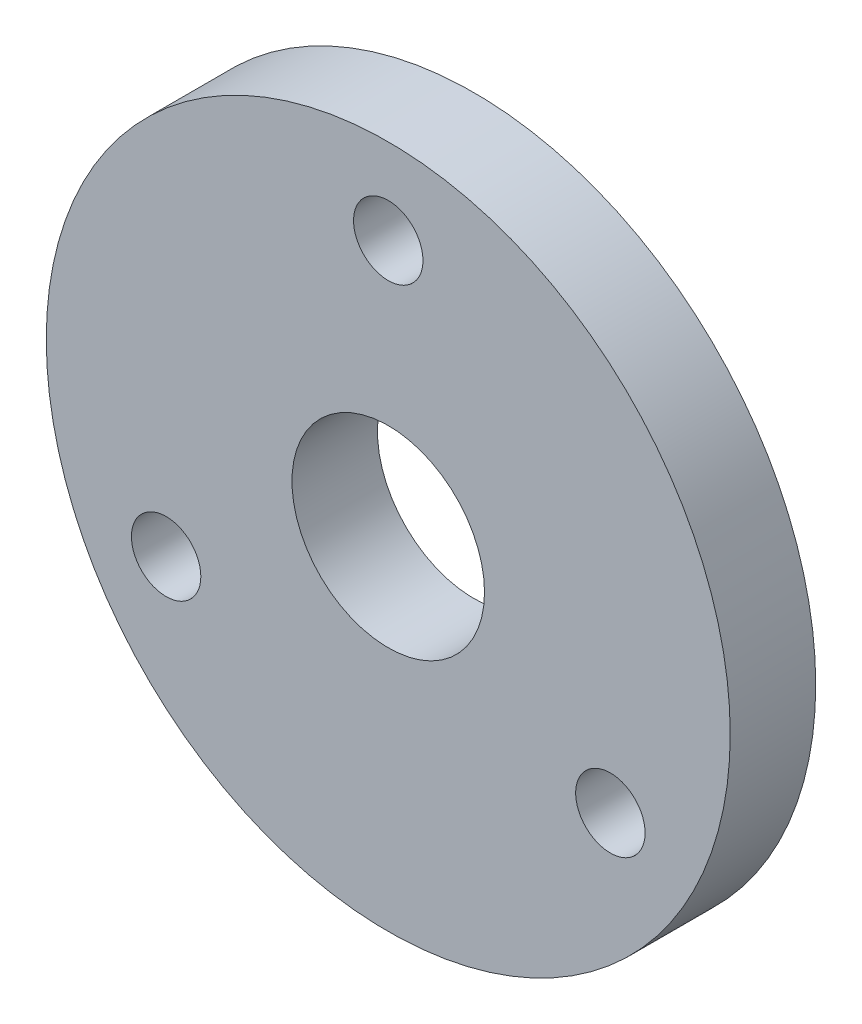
from build123d import *

# Parameters (mm, degrees)
SKETCH1_R         = 25.4
SKETCH1_R_2       = 7.1501
EXTRUDE1_DEPTH    = 3.175
HOLE1_D           = 5.1562
HOLE1_DEPTH       = 100
CIRPATTERN1_COUNT = 3


with BuildPart() as part:
    # Sketch1 → Extrude1 (new, symmetric)
    with BuildSketch(Plane.XY):
        Circle(SKETCH1_R)
        Circle(SKETCH1_R_2, mode=Mode.SUBTRACT)
    extrude(amount=EXTRUDE1_DEPTH, both=True)

    # Hole1
    with Locations(Plane.XY.offset(3.175)):
        with Locations((0, 19.05)):
            hole1 = Hole(HOLE1_D / 2, depth=HOLE1_DEPTH)

    # CirPattern1: Hole1 ×3 about axis
    cirpattern1_axis = Axis((0, 0, 0), (0, 0, 1))
    for i in range(1, CIRPATTERN1_COUNT):
        add(hole1.rotate(cirpattern1_axis, i * 360 / CIRPATTERN1_COUNT), mode=Mode.SUBTRACT)


solid = part.part
